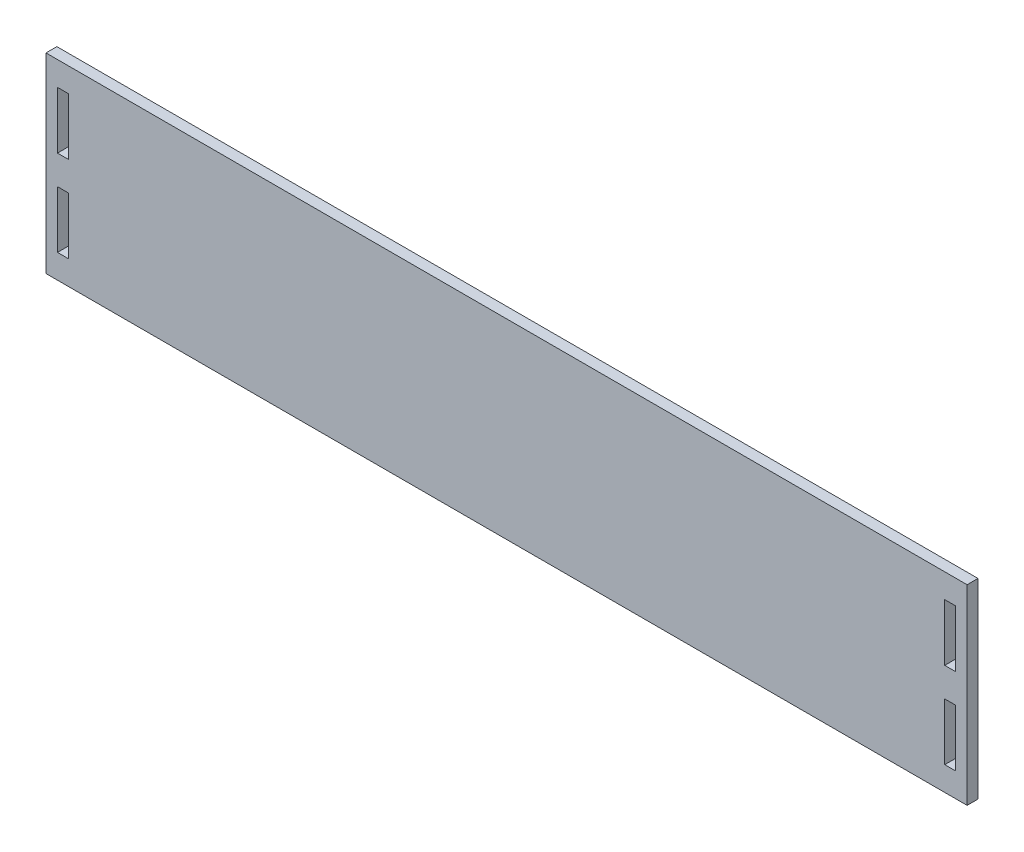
from build123d import *

# Parameters (mm, degrees)
CROQUIS1_W              = 482
CROQUIS1_H              = 100
SALIENTE_EXTRUIR1_DEPTH = 5.7
CORTAR_EXTRUIR1_REACH   = 248.198
CROQUIS2_W              = 5.7
CROQUIS2_H              = 29.8


with BuildPart() as part:
    # Croquis1 → Saliente-Extruir1 (new body)
    with BuildSketch(Plane.XY):
        Rectangle(CROQUIS1_W, CROQUIS1_H)
    extrude(amount=SALIENTE_EXTRUIR1_DEPTH)

    # Croquis2 → Cortar-Extruir1 (cut, up to next)
    with BuildSketch(Plane.XY.offset(5.7), mode=Mode.PRIVATE) as cortar_extruir1_sk1:
        with Locations((-232.15, 22.5)):
            Rectangle(CROQUIS2_W, CROQUIS2_H)
    cortar_extruir1_tool1 = extrude(cortar_extruir1_sk1.sketch, amount=-CORTAR_EXTRUIR1_REACH, mode=Mode.PRIVATE) & part.part
    # Croquis2 → Cortar-Extruir1 (cut, up to next)
    with BuildSketch(Plane.XY.offset(5.7), mode=Mode.PRIVATE) as cortar_extruir1_sk2:
        with Locations((-232.15, -22.5)):
            Rectangle(CROQUIS2_W, CROQUIS2_H)
    cortar_extruir1_tool2 = extrude(cortar_extruir1_sk2.sketch, amount=-CORTAR_EXTRUIR1_REACH, mode=Mode.PRIVATE) & part.part
    # Croquis2 → Cortar-Extruir1 (cut, up to next)
    with BuildSketch(Plane.XY.offset(5.7), mode=Mode.PRIVATE) as cortar_extruir1_sk3:
        with Locations((232.15, -22.5)):
            Rectangle(CROQUIS2_W, CROQUIS2_H)
    cortar_extruir1_tool3 = extrude(cortar_extruir1_sk3.sketch, amount=-CORTAR_EXTRUIR1_REACH, mode=Mode.PRIVATE) & part.part
    # Croquis2 → Cortar-Extruir1 (cut, up to next)
    with BuildSketch(Plane.XY.offset(5.7), mode=Mode.PRIVATE) as cortar_extruir1_sk4:
        with Locations((232.15, 22.5)):
            Rectangle(CROQUIS2_W, CROQUIS2_H)
    cortar_extruir1_tool4 = extrude(cortar_extruir1_sk4.sketch, amount=-CORTAR_EXTRUIR1_REACH, mode=Mode.PRIVATE) & part.part
    add(cortar_extruir1_tool1.solids().sort_by_distance((-232.15, 22.5, 5.7))[0], mode=Mode.SUBTRACT)
    add(cortar_extruir1_tool2.solids().sort_by_distance((-232.15, -22.5, 5.7))[0], mode=Mode.SUBTRACT)
    add(cortar_extruir1_tool3.solids().sort_by_distance((232.15, -22.5, 5.7))[0], mode=Mode.SUBTRACT)
    add(cortar_extruir1_tool4.solids().sort_by_distance((232.15, 22.5, 5.7))[0], mode=Mode.SUBTRACT)


solid = part.part
